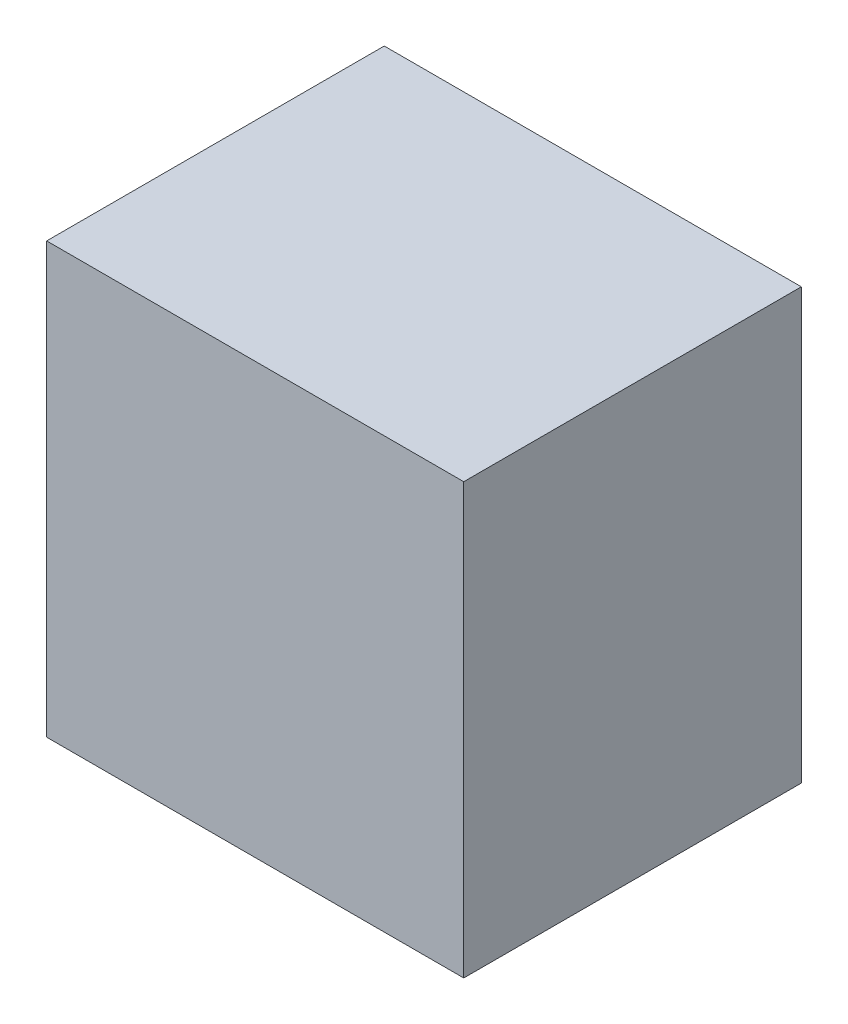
ISO-10303-21;
HEADER;
FILE_DESCRIPTION(('STEP AP214'),'2;1');
FILE_NAME('part.step','',(''),(''),'','','');
FILE_SCHEMA(('AUTOMOTIVE_DESIGN { 1 0 10303 214 1 1 1 1 }'));
ENDSEC;
DATA;
#1=APPLICATION_CONTEXT('core data for automotive mechanical design processes');
#2=APPLICATION_PROTOCOL_DEFINITION('international standard','automotive_design',2000,#1);
#3=PRODUCT_CONTEXT('',#1,'mechanical');
#4=PRODUCT('Part','Part','',(#3));
#5=PRODUCT_RELATED_PRODUCT_CATEGORY('part','',(#4));
#6=PRODUCT_DEFINITION_FORMATION('','',#4);
#7=PRODUCT_DEFINITION_CONTEXT('part definition',#1,'design');
#8=PRODUCT_DEFINITION('design','',#6,#7);
#9=PRODUCT_DEFINITION_SHAPE('','',#8);
#10=(LENGTH_UNIT() NAMED_UNIT(*) SI_UNIT(.MILLI.,.METRE.));
#11=(NAMED_UNIT(*) PLANE_ANGLE_UNIT() SI_UNIT($,.RADIAN.));
#12=(NAMED_UNIT(*) SI_UNIT($,.STERADIAN.) SOLID_ANGLE_UNIT());
#13=UNCERTAINTY_MEASURE_WITH_UNIT(LENGTH_MEASURE(1.E-05),#10,'distance_accuracy_value','');
#14=(GEOMETRIC_REPRESENTATION_CONTEXT(3) GLOBAL_UNCERTAINTY_ASSIGNED_CONTEXT((#13)) GLOBAL_UNIT_ASSIGNED_CONTEXT((#10,
#11,#12)) REPRESENTATION_CONTEXT('',''));
#15=CARTESIAN_POINT('',(0.,0.,0.));
#16=DIRECTION('',(0.,0.,1.));
#17=DIRECTION('',(1.,0.,0.));
#18=AXIS2_PLACEMENT_3D('',#15,#16,#17);
#19=CARTESIAN_POINT('',(-19.1685827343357,-19.7538829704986,31.0297909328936));
#20=DIRECTION('',(-1.,0.,0.));
#21=DIRECTION('',(0.,0.,1.));
#22=AXIS2_PLACEMENT_3D('',#19,#20,#21);
#23=PLANE('',#22);
#24=DIRECTION('',(0.,1.,0.));
#25=VECTOR('',#24,1.);
#26=CARTESIAN_POINT('',(-19.1685827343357,-19.7538829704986,0.));
#27=LINE('',#26,#25);
#28=CARTESIAN_POINT('',(-19.1685827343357,-19.7538829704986,0.));
#29=VERTEX_POINT('',#28);
#30=CARTESIAN_POINT('',(-19.1685827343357,19.7538829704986,0.));
#31=VERTEX_POINT('',#30);
#32=EDGE_CURVE('E98',#29,#31,#27,.T.);
#33=ORIENTED_EDGE('',*,*,#32,.F.);
#34=DIRECTION('',(0.,0.,-1.));
#35=VECTOR('',#34,1.);
#36=CARTESIAN_POINT('',(-19.1685827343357,-19.7538829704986,31.0297909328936));
#37=LINE('',#36,#35);
#38=CARTESIAN_POINT('',(-19.1685827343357,-19.7538829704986,31.0297909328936));
#39=VERTEX_POINT('',#38);
#40=EDGE_CURVE('E11',#39,#29,#37,.T.);
#41=ORIENTED_EDGE('',*,*,#40,.F.);
#42=DIRECTION('',(0.,1.,0.));
#43=VECTOR('',#42,1.);
#44=CARTESIAN_POINT('',(-19.1685827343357,-19.7538829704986,31.0297909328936));
#45=LINE('',#44,#43);
#46=CARTESIAN_POINT('',(-19.1685827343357,19.7538829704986,31.0297909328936));
#47=VERTEX_POINT('',#46);
#48=EDGE_CURVE('E93',#39,#47,#45,.T.);
#49=ORIENTED_EDGE('',*,*,#48,.T.);
#50=DIRECTION('',(0.,0.,-1.));
#51=VECTOR('',#50,1.);
#52=CARTESIAN_POINT('',(-19.1685827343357,19.7538829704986,31.0297909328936));
#53=LINE('',#52,#51);
#54=EDGE_CURVE('E36',#47,#31,#53,.T.);
#55=ORIENTED_EDGE('',*,*,#54,.T.);
#56=EDGE_LOOP('',(#33,#41,#49,#55));
#57=FACE_BOUND('',#56,.T.);
#58=ADVANCED_FACE('F33',(#57),#23,.T.);
#59=CARTESIAN_POINT('',(-19.1685827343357,-19.7538829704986,31.0297909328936));
#60=DIRECTION('',(0.,1.,0.));
#61=DIRECTION('',(0.,0.,1.));
#62=AXIS2_PLACEMENT_3D('',#59,#60,#61);
#63=PLANE('',#62);
#64=DIRECTION('',(1.,0.,0.));
#65=VECTOR('',#64,1.);
#66=CARTESIAN_POINT('',(-19.1685827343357,-19.7538829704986,0.));
#67=LINE('',#66,#65);
#68=CARTESIAN_POINT('',(19.1685827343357,-19.7538829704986,0.));
#69=VERTEX_POINT('',#68);
#70=EDGE_CURVE('E66',#29,#69,#67,.T.);
#71=ORIENTED_EDGE('',*,*,#70,.T.);
#72=DIRECTION('',(0.,0.,-1.));
#73=VECTOR('',#72,1.);
#74=CARTESIAN_POINT('',(19.1685827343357,-19.7538829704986,31.0297909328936));
#75=LINE('',#74,#73);
#76=CARTESIAN_POINT('',(19.1685827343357,-19.7538829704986,31.0297909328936));
#77=VERTEX_POINT('',#76);
#78=EDGE_CURVE('E42',#77,#69,#75,.T.);
#79=ORIENTED_EDGE('',*,*,#78,.F.);
#80=DIRECTION('',(1.,0.,0.));
#81=VECTOR('',#80,1.);
#82=CARTESIAN_POINT('',(-19.1685827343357,-19.7538829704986,31.0297909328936));
#83=LINE('',#82,#81);
#84=EDGE_CURVE('E83',#39,#77,#83,.T.);
#85=ORIENTED_EDGE('',*,*,#84,.F.);
#86=ORIENTED_EDGE('',*,*,#40,.T.);
#87=EDGE_LOOP('',(#71,#79,#85,#86));
#88=FACE_BOUND('',#87,.T.);
#89=ADVANCED_FACE('F108',(#88),#63,.F.);
#90=CARTESIAN_POINT('',(19.1685827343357,-19.7538829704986,31.0297909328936));
#91=DIRECTION('',(-1.,0.,0.));
#92=DIRECTION('',(0.,0.,1.));
#93=AXIS2_PLACEMENT_3D('',#90,#91,#92);
#94=PLANE('',#93);
#95=DIRECTION('',(0.,1.,0.));
#96=VECTOR('',#95,1.);
#97=CARTESIAN_POINT('',(19.1685827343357,-19.7538829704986,0.));
#98=LINE('',#97,#96);
#99=CARTESIAN_POINT('',(19.1685827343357,19.7538829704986,0.));
#100=VERTEX_POINT('',#99);
#101=EDGE_CURVE('E90',#69,#100,#98,.T.);
#102=ORIENTED_EDGE('',*,*,#101,.T.);
#103=DIRECTION('',(0.,0.,-1.));
#104=VECTOR('',#103,1.);
#105=CARTESIAN_POINT('',(19.1685827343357,19.7538829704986,31.0297909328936));
#106=LINE('',#105,#104);
#107=CARTESIAN_POINT('',(19.1685827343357,19.7538829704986,31.0297909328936));
#108=VERTEX_POINT('',#107);
#109=EDGE_CURVE('E87',#108,#100,#106,.T.);
#110=ORIENTED_EDGE('',*,*,#109,.F.);
#111=DIRECTION('',(0.,1.,0.));
#112=VECTOR('',#111,1.);
#113=CARTESIAN_POINT('',(19.1685827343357,-19.7538829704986,31.0297909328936));
#114=LINE('',#113,#112);
#115=EDGE_CURVE('E78',#77,#108,#114,.T.);
#116=ORIENTED_EDGE('',*,*,#115,.F.);
#117=ORIENTED_EDGE('',*,*,#78,.T.);
#118=EDGE_LOOP('',(#102,#110,#116,#117));
#119=FACE_BOUND('',#118,.T.);
#120=ADVANCED_FACE('F88',(#119),#94,.F.);
#121=CARTESIAN_POINT('',(-19.1685827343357,19.7538829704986,31.0297909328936));
#122=DIRECTION('',(0.,1.,0.));
#123=DIRECTION('',(0.,0.,1.));
#124=AXIS2_PLACEMENT_3D('',#121,#122,#123);
#125=PLANE('',#124);
#126=DIRECTION('',(1.,0.,0.));
#127=VECTOR('',#126,1.);
#128=CARTESIAN_POINT('',(-19.1685827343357,19.7538829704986,0.));
#129=LINE('',#128,#127);
#130=EDGE_CURVE('E101',#31,#100,#129,.T.);
#131=ORIENTED_EDGE('',*,*,#130,.F.);
#132=ORIENTED_EDGE('',*,*,#54,.F.);
#133=DIRECTION('',(1.,0.,0.));
#134=VECTOR('',#133,1.);
#135=CARTESIAN_POINT('',(-19.1685827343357,19.7538829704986,31.0297909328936));
#136=LINE('',#135,#134);
#137=EDGE_CURVE('E82',#47,#108,#136,.T.);
#138=ORIENTED_EDGE('',*,*,#137,.T.);
#139=ORIENTED_EDGE('',*,*,#109,.T.);
#140=EDGE_LOOP('',(#131,#132,#138,#139));
#141=FACE_BOUND('',#140,.T.);
#142=ADVANCED_FACE('F92',(#141),#125,.T.);
#143=CARTESIAN_POINT('',(0.,0.,31.0297909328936));
#144=DIRECTION('',(0.,0.,-1.));
#145=DIRECTION('',(-1.,0.,0.));
#146=AXIS2_PLACEMENT_3D('',#143,#144,#145);
#147=PLANE('',#146);
#148=ORIENTED_EDGE('',*,*,#48,.F.);
#149=ORIENTED_EDGE('',*,*,#84,.T.);
#150=ORIENTED_EDGE('',*,*,#115,.T.);
#151=ORIENTED_EDGE('',*,*,#137,.F.);
#152=EDGE_LOOP('',(#148,#149,#150,#151));
#153=FACE_BOUND('',#152,.T.);
#154=ADVANCED_FACE('F81',(#153),#147,.F.);
#155=CARTESIAN_POINT('',(0.,0.,0.));
#156=DIRECTION('',(0.,0.,-1.));
#157=DIRECTION('',(-1.,0.,0.));
#158=AXIS2_PLACEMENT_3D('',#155,#156,#157);
#159=PLANE('',#158);
#160=ORIENTED_EDGE('',*,*,#32,.T.);
#161=ORIENTED_EDGE('',*,*,#130,.T.);
#162=ORIENTED_EDGE('',*,*,#101,.F.);
#163=ORIENTED_EDGE('',*,*,#70,.F.);
#164=EDGE_LOOP('',(#160,#161,#162,#163));
#165=FACE_BOUND('',#164,.T.);
#166=ADVANCED_FACE('F106',(#165),#159,.T.);
#167=CLOSED_SHELL('',(#58,#89,#120,#142,#154,#166));
#168=MANIFOLD_SOLID_BREP('B2',#167);
#169=ADVANCED_BREP_SHAPE_REPRESENTATION('',(#18,#168),#14);
#170=SHAPE_DEFINITION_REPRESENTATION(#9,#169);
ENDSEC;
END-ISO-10303-21;
